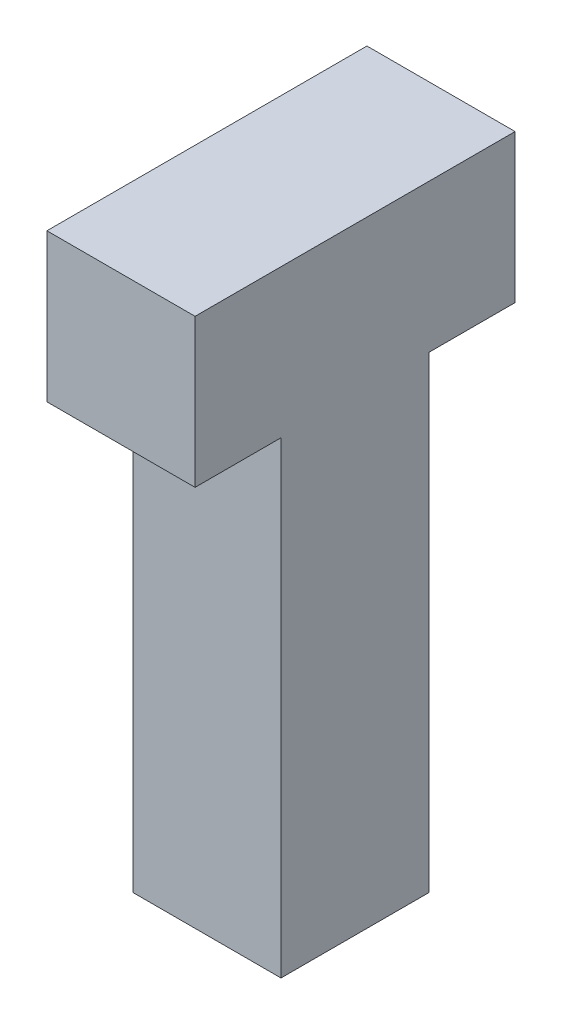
from build123d import *

# Parameters (mm, degrees)
SKETCH1_W           = 9.5
SKETCH1_H           = 9.5
BOSS_EXTRUDE1_DEPTH = 20.52
SKETCH2_W           = 9.5
SKETCH2_H           = 9.5
BOSS_EXTRUDE2_DEPTH = 30


with BuildPart() as part:
    # Sketch1 → Boss-Extrude1 (new body)
    with BuildSketch(Plane.XY):
        with Locations((4.75, -4.75)):
            Rectangle(SKETCH1_W, SKETCH1_H)
    extrude(amount=BOSS_EXTRUDE1_DEPTH)

    # Sketch2 → Boss-Extrude2 (add)
    with BuildSketch(Plane.XZ.offset(9.5)):
        with Locations((4.75, 10.26)):
            Rectangle(SKETCH2_W, SKETCH2_H)
    extrude(amount=BOSS_EXTRUDE2_DEPTH)


solid = part.part
